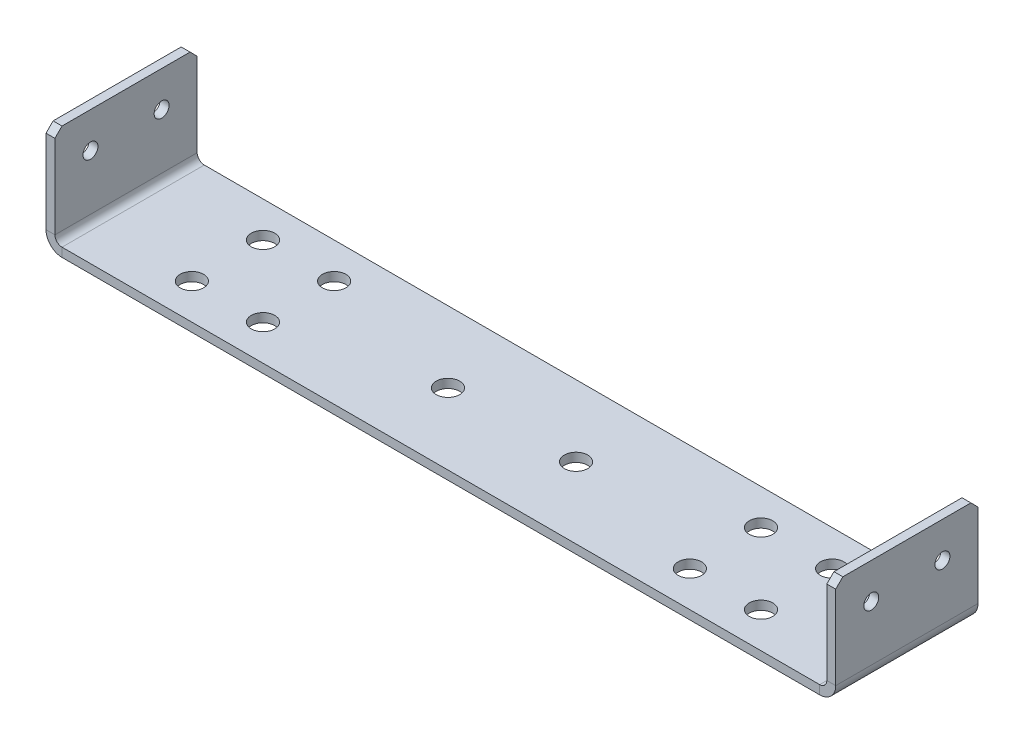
ISO-10303-21;
HEADER;
FILE_DESCRIPTION(('STEP AP214'),'2;1');
FILE_NAME('part.step','',(''),(''),'','','');
FILE_SCHEMA(('AUTOMOTIVE_DESIGN { 1 0 10303 214 1 1 1 1 }'));
ENDSEC;
DATA;
#1=APPLICATION_CONTEXT('core data for automotive mechanical design processes');
#2=APPLICATION_PROTOCOL_DEFINITION('international standard','automotive_design',2000,#1);
#3=PRODUCT_CONTEXT('',#1,'mechanical');
#4=PRODUCT('Part','Part','',(#3));
#5=PRODUCT_RELATED_PRODUCT_CATEGORY('part','',(#4));
#6=PRODUCT_DEFINITION_FORMATION('','',#4);
#7=PRODUCT_DEFINITION_CONTEXT('part definition',#1,'design');
#8=PRODUCT_DEFINITION('design','',#6,#7);
#9=PRODUCT_DEFINITION_SHAPE('','',#8);
#10=(LENGTH_UNIT() NAMED_UNIT(*) SI_UNIT(.MILLI.,.METRE.));
#11=(NAMED_UNIT(*) PLANE_ANGLE_UNIT() SI_UNIT($,.RADIAN.));
#12=(NAMED_UNIT(*) SI_UNIT($,.STERADIAN.) SOLID_ANGLE_UNIT());
#13=UNCERTAINTY_MEASURE_WITH_UNIT(LENGTH_MEASURE(1.E-05),#10,'distance_accuracy_value','');
#14=(GEOMETRIC_REPRESENTATION_CONTEXT(3) GLOBAL_UNCERTAINTY_ASSIGNED_CONTEXT((#13)) GLOBAL_UNIT_ASSIGNED_CONTEXT((#10,
#11,#12)) REPRESENTATION_CONTEXT('',''));
#15=CARTESIAN_POINT('',(0.,0.,0.));
#16=DIRECTION('',(0.,0.,1.));
#17=DIRECTION('',(1.,0.,0.));
#18=AXIS2_PLACEMENT_3D('',#15,#16,#17);
#19=CARTESIAN_POINT('',(-111.,4.5,20.));
#20=DIRECTION('',(0.,0.,1.));
#21=DIRECTION('',(1.,0.,0.));
#22=AXIS2_PLACEMENT_3D('',#19,#20,#21);
#23=PLANE('',#22);
#24=DIRECTION('',(1.,0.,0.));
#25=VECTOR('',#24,1.);
#26=CARTESIAN_POINT('',(-111.,4.5,20.));
#27=LINE('',#26,#25);
#28=CARTESIAN_POINT('',(-111.,4.5,20.));
#29=VERTEX_POINT('',#28);
#30=CARTESIAN_POINT('',(-108.5,4.5,20.));
#31=VERTEX_POINT('',#30);
#32=EDGE_CURVE('E279',#29,#31,#27,.T.);
#33=ORIENTED_EDGE('',*,*,#32,.F.);
#34=CARTESIAN_POINT('',(-106.5,4.5,20.));
#35=DIRECTION('',(0.,0.,-1.));
#36=DIRECTION('',(-1.,0.,0.));
#37=AXIS2_PLACEMENT_3D('',#34,#35,#36);
#38=CIRCLE('',#37,4.5);
#39=CARTESIAN_POINT('',(-106.5,0.,20.));
#40=VERTEX_POINT('',#39);
#41=EDGE_CURVE('E206',#29,#40,#38,.F.);
#42=ORIENTED_EDGE('',*,*,#41,.T.);
#43=DIRECTION('',(0.,-1.,0.));
#44=VECTOR('',#43,1.);
#45=CARTESIAN_POINT('',(-106.5,2.5,20.));
#46=LINE('',#45,#44);
#47=CARTESIAN_POINT('',(-106.5,2.5,20.));
#48=VERTEX_POINT('',#47);
#49=EDGE_CURVE('E277',#48,#40,#46,.T.);
#50=ORIENTED_EDGE('',*,*,#49,.F.);
#51=CARTESIAN_POINT('',(-106.5,4.5,20.));
#52=DIRECTION('',(0.,0.,1.));
#53=DIRECTION('',(1.,0.,0.));
#54=AXIS2_PLACEMENT_3D('',#51,#52,#53);
#55=CIRCLE('',#54,2.);
#56=EDGE_CURVE('E196',#31,#48,#55,.T.);
#57=ORIENTED_EDGE('',*,*,#56,.F.);
#58=EDGE_LOOP('',(#33,#42,#50,#57));
#59=FACE_BOUND('',#58,.T.);
#60=ADVANCED_FACE('F38',(#59),#23,.T.);
#61=CARTESIAN_POINT('',(-106.5,2.5,20.));
#62=DIRECTION('',(0.,0.,1.));
#63=DIRECTION('',(1.,0.,0.));
#64=AXIS2_PLACEMENT_3D('',#61,#62,#63);
#65=PLANE('',#64);
#66=DIRECTION('',(0.,1.,0.));
#67=VECTOR('',#66,1.);
#68=CARTESIAN_POINT('',(-108.5,30.,20.));
#69=LINE('',#68,#67);
#70=CARTESIAN_POINT('',(-108.5,28.,20.));
#71=VERTEX_POINT('',#70);
#72=EDGE_CURVE('E202',#71,#31,#69,.F.);
#73=ORIENTED_EDGE('',*,*,#72,.F.);
#74=DIRECTION('',(-1.,0.,0.));
#75=VECTOR('',#74,1.);
#76=CARTESIAN_POINT('',(-106.5,28.,20.));
#77=LINE('',#76,#75);
#78=CARTESIAN_POINT('',(-111.,28.,20.));
#79=VERTEX_POINT('',#78);
#80=EDGE_CURVE('E63',#71,#79,#77,.T.);
#81=ORIENTED_EDGE('',*,*,#80,.T.);
#82=DIRECTION('',(0.,-1.,0.));
#83=VECTOR('',#82,1.);
#84=CARTESIAN_POINT('',(-111.,30.,20.));
#85=LINE('',#84,#83);
#86=EDGE_CURVE('E204',#79,#29,#85,.T.);
#87=ORIENTED_EDGE('',*,*,#86,.T.);
#88=ORIENTED_EDGE('',*,*,#32,.T.);
#89=EDGE_LOOP('',(#73,#81,#87,#88));
#90=FACE_BOUND('',#89,.T.);
#91=ADVANCED_FACE('F405',(#90),#65,.T.);
#92=CARTESIAN_POINT('',(-106.5,0.,-20.));
#93=DIRECTION('',(0.,0.,-1.));
#94=DIRECTION('',(-1.,0.,0.));
#95=AXIS2_PLACEMENT_3D('',#92,#93,#94);
#96=PLANE('',#95);
#97=DIRECTION('',(0.,1.,0.));
#98=VECTOR('',#97,1.);
#99=CARTESIAN_POINT('',(-106.5,0.,-20.));
#100=LINE('',#99,#98);
#101=CARTESIAN_POINT('',(-106.5,0.,-20.));
#102=VERTEX_POINT('',#101);
#103=CARTESIAN_POINT('',(-106.5,2.5,-20.));
#104=VERTEX_POINT('',#103);
#105=EDGE_CURVE('E275',#102,#104,#100,.T.);
#106=ORIENTED_EDGE('',*,*,#105,.F.);
#107=CARTESIAN_POINT('',(-106.5,4.5,-20.));
#108=DIRECTION('',(0.,0.,-1.));
#109=DIRECTION('',(-1.,0.,0.));
#110=AXIS2_PLACEMENT_3D('',#107,#108,#109);
#111=CIRCLE('',#110,4.5);
#112=CARTESIAN_POINT('',(-111.,4.5,-20.));
#113=VERTEX_POINT('',#112);
#114=EDGE_CURVE('E231',#113,#102,#111,.F.);
#115=ORIENTED_EDGE('',*,*,#114,.F.);
#116=DIRECTION('',(-1.,0.,0.));
#117=VECTOR('',#116,1.);
#118=CARTESIAN_POINT('',(-108.5,4.5,-20.));
#119=LINE('',#118,#117);
#120=CARTESIAN_POINT('',(-108.5,4.5,-20.));
#121=VERTEX_POINT('',#120);
#122=EDGE_CURVE('E272',#121,#113,#119,.T.);
#123=ORIENTED_EDGE('',*,*,#122,.F.);
#124=CARTESIAN_POINT('',(-106.5,4.5,-20.));
#125=DIRECTION('',(0.,0.,1.));
#126=DIRECTION('',(1.,0.,0.));
#127=AXIS2_PLACEMENT_3D('',#124,#125,#126);
#128=CIRCLE('',#127,2.);
#129=EDGE_CURVE('E224',#121,#104,#128,.T.);
#130=ORIENTED_EDGE('',*,*,#129,.T.);
#131=EDGE_LOOP('',(#106,#115,#123,#130));
#132=FACE_BOUND('',#131,.T.);
#133=ADVANCED_FACE('F411',(#132),#96,.T.);
#134=CARTESIAN_POINT('',(-108.5,4.5,-20.));
#135=DIRECTION('',(0.,0.,-1.));
#136=DIRECTION('',(-1.,0.,0.));
#137=AXIS2_PLACEMENT_3D('',#134,#135,#136);
#138=PLANE('',#137);
#139=DIRECTION('',(1.,0.,0.));
#140=VECTOR('',#139,1.);
#141=CARTESIAN_POINT('',(-111.,0.,-20.));
#142=LINE('',#141,#140);
#143=CARTESIAN_POINT('',(106.5,0.,-20.));
#144=VERTEX_POINT('',#143);
#145=EDGE_CURVE('E234',#102,#144,#142,.T.);
#146=ORIENTED_EDGE('',*,*,#145,.F.);
#147=ORIENTED_EDGE('',*,*,#105,.T.);
#148=DIRECTION('',(1.,0.,0.));
#149=VECTOR('',#148,1.);
#150=CARTESIAN_POINT('',(-111.,2.5,-20.));
#151=LINE('',#150,#149);
#152=CARTESIAN_POINT('',(106.5,2.50000000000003,-20.));
#153=VERTEX_POINT('',#152);
#154=EDGE_CURVE('E221',#104,#153,#151,.T.);
#155=ORIENTED_EDGE('',*,*,#154,.T.);
#156=DIRECTION('',(0.,-1.,0.));
#157=VECTOR('',#156,1.);
#158=CARTESIAN_POINT('',(106.5,2.50000000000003,-20.));
#159=LINE('',#158,#157);
#160=EDGE_CURVE('E268',#153,#144,#159,.T.);
#161=ORIENTED_EDGE('',*,*,#160,.T.);
#162=EDGE_LOOP('',(#146,#147,#155,#161));
#163=FACE_BOUND('',#162,.T.);
#164=ADVANCED_FACE('F466',(#163),#138,.T.);
#165=CARTESIAN_POINT('',(106.5,0.,20.));
#166=DIRECTION('',(0.,0.,1.));
#167=DIRECTION('',(1.,0.,0.));
#168=AXIS2_PLACEMENT_3D('',#165,#166,#167);
#169=PLANE('',#168);
#170=DIRECTION('',(0.,1.,0.));
#171=VECTOR('',#170,1.);
#172=CARTESIAN_POINT('',(106.5,0.,20.));
#173=LINE('',#172,#171);
#174=CARTESIAN_POINT('',(106.5,0.,20.));
#175=VERTEX_POINT('',#174);
#176=CARTESIAN_POINT('',(106.5,2.50000000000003,20.));
#177=VERTEX_POINT('',#176);
#178=EDGE_CURVE('E167',#175,#177,#173,.T.);
#179=ORIENTED_EDGE('',*,*,#178,.F.);
#180=CARTESIAN_POINT('',(106.5,4.50000000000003,20.));
#181=DIRECTION('',(0.,0.,-1.));
#182=DIRECTION('',(-1.,0.,0.));
#183=AXIS2_PLACEMENT_3D('',#180,#181,#182);
#184=CIRCLE('',#183,4.5);
#185=CARTESIAN_POINT('',(111.,4.50000000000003,20.));
#186=VERTEX_POINT('',#185);
#187=EDGE_CURVE('E162',#175,#186,#184,.F.);
#188=ORIENTED_EDGE('',*,*,#187,.T.);
#189=DIRECTION('',(1.,0.,0.));
#190=VECTOR('',#189,1.);
#191=CARTESIAN_POINT('',(108.5,4.50000000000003,20.));
#192=LINE('',#191,#190);
#193=CARTESIAN_POINT('',(108.5,4.50000000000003,20.));
#194=VERTEX_POINT('',#193);
#195=EDGE_CURVE('E155',#194,#186,#192,.T.);
#196=ORIENTED_EDGE('',*,*,#195,.F.);
#197=CARTESIAN_POINT('',(106.5,4.50000000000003,20.));
#198=DIRECTION('',(0.,0.,1.));
#199=DIRECTION('',(1.,0.,0.));
#200=AXIS2_PLACEMENT_3D('',#197,#198,#199);
#201=CIRCLE('',#200,2.);
#202=EDGE_CURVE('E159',#177,#194,#201,.T.);
#203=ORIENTED_EDGE('',*,*,#202,.F.);
#204=EDGE_LOOP('',(#179,#188,#196,#203));
#205=FACE_BOUND('',#204,.T.);
#206=ADVANCED_FACE('F157',(#205),#169,.T.);
#207=CARTESIAN_POINT('',(108.5,4.50000000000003,20.));
#208=DIRECTION('',(0.,0.,1.));
#209=DIRECTION('',(1.,0.,0.));
#210=AXIS2_PLACEMENT_3D('',#207,#208,#209);
#211=PLANE('',#210);
#212=DIRECTION('',(1.,0.,0.));
#213=VECTOR('',#212,1.);
#214=CARTESIAN_POINT('',(-111.,0.,20.));
#215=LINE('',#214,#213);
#216=EDGE_CURVE('E209',#40,#175,#215,.T.);
#217=ORIENTED_EDGE('',*,*,#216,.T.);
#218=ORIENTED_EDGE('',*,*,#178,.T.);
#219=DIRECTION('',(1.,0.,0.));
#220=VECTOR('',#219,1.);
#221=CARTESIAN_POINT('',(-111.,2.5,20.));
#222=LINE('',#221,#220);
#223=EDGE_CURVE('E194',#48,#177,#222,.T.);
#224=ORIENTED_EDGE('',*,*,#223,.F.);
#225=ORIENTED_EDGE('',*,*,#49,.T.);
#226=EDGE_LOOP('',(#217,#218,#224,#225));
#227=FACE_BOUND('',#226,.T.);
#228=ADVANCED_FACE('F461',(#227),#211,.T.);
#229=CARTESIAN_POINT('',(111.,4.50000000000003,-20.));
#230=DIRECTION('',(0.,0.,-1.));
#231=DIRECTION('',(-1.,0.,0.));
#232=AXIS2_PLACEMENT_3D('',#229,#230,#231);
#233=PLANE('',#232);
#234=DIRECTION('',(-1.,0.,0.));
#235=VECTOR('',#234,1.);
#236=CARTESIAN_POINT('',(111.,4.50000000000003,-20.));
#237=LINE('',#236,#235);
#238=CARTESIAN_POINT('',(111.,4.50000000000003,-20.));
#239=VERTEX_POINT('',#238);
#240=CARTESIAN_POINT('',(108.5,4.50000000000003,-20.));
#241=VERTEX_POINT('',#240);
#242=EDGE_CURVE('E168',#239,#241,#237,.T.);
#243=ORIENTED_EDGE('',*,*,#242,.F.);
#244=CARTESIAN_POINT('',(106.5,4.50000000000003,-20.));
#245=DIRECTION('',(0.,0.,-1.));
#246=DIRECTION('',(-1.,0.,0.));
#247=AXIS2_PLACEMENT_3D('',#244,#245,#246);
#248=CIRCLE('',#247,4.5);
#249=EDGE_CURVE('E237',#144,#239,#248,.F.);
#250=ORIENTED_EDGE('',*,*,#249,.F.);
#251=ORIENTED_EDGE('',*,*,#160,.F.);
#252=CARTESIAN_POINT('',(106.5,4.50000000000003,-20.));
#253=DIRECTION('',(0.,0.,1.));
#254=DIRECTION('',(1.,0.,0.));
#255=AXIS2_PLACEMENT_3D('',#252,#253,#254);
#256=CIRCLE('',#255,2.);
#257=EDGE_CURVE('E219',#153,#241,#256,.T.);
#258=ORIENTED_EDGE('',*,*,#257,.T.);
#259=EDGE_LOOP('',(#243,#250,#251,#258));
#260=FACE_BOUND('',#259,.T.);
#261=ADVANCED_FACE('F389',(#260),#233,.T.);
#262=CARTESIAN_POINT('',(106.5,2.50000000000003,-20.));
#263=DIRECTION('',(0.,0.,-1.));
#264=DIRECTION('',(-1.,0.,0.));
#265=AXIS2_PLACEMENT_3D('',#262,#263,#264);
#266=PLANE('',#265);
#267=DIRECTION('',(0.,1.,0.));
#268=VECTOR('',#267,1.);
#269=CARTESIAN_POINT('',(108.5,0.,-20.));
#270=LINE('',#269,#268);
#271=CARTESIAN_POINT('',(108.5,28.,-20.));
#272=VERTEX_POINT('',#271);
#273=EDGE_CURVE('E179',#241,#272,#270,.T.);
#274=ORIENTED_EDGE('',*,*,#273,.T.);
#275=DIRECTION('',(1.,0.,0.));
#276=VECTOR('',#275,1.);
#277=CARTESIAN_POINT('',(106.5,28.,-20.));
#278=LINE('',#277,#276);
#279=CARTESIAN_POINT('',(111.,28.,-20.));
#280=VERTEX_POINT('',#279);
#281=EDGE_CURVE('E296',#272,#280,#278,.T.);
#282=ORIENTED_EDGE('',*,*,#281,.T.);
#283=DIRECTION('',(0.,1.,0.));
#284=VECTOR('',#283,1.);
#285=CARTESIAN_POINT('',(111.,0.,-20.));
#286=LINE('',#285,#284);
#287=EDGE_CURVE('E214',#239,#280,#286,.T.);
#288=ORIENTED_EDGE('',*,*,#287,.F.);
#289=ORIENTED_EDGE('',*,*,#242,.T.);
#290=EDGE_LOOP('',(#274,#282,#288,#289));
#291=FACE_BOUND('',#290,.T.);
#292=ADVANCED_FACE('F385',(#291),#266,.T.);
#293=CARTESIAN_POINT('',(111.,0.,20.));
#294=DIRECTION('',(-1.,0.,0.));
#295=DIRECTION('',(0.,-1.,0.));
#296=AXIS2_PLACEMENT_3D('',#293,#294,#295);
#297=PLANE('',#296);
#298=CARTESIAN_POINT('',(111.,20.,-10.));
#299=DIRECTION('',(-1.,0.,0.));
#300=DIRECTION('',(0.,-1.,0.));
#301=AXIS2_PLACEMENT_3D('',#298,#299,#300);
#302=CIRCLE('',#301,2.1);
#303=CARTESIAN_POINT('',(111.,17.9,-10.));
#304=VERTEX_POINT('',#303);
#305=EDGE_CURVE('E363',#304,#304,#302,.T.);
#306=ORIENTED_EDGE('',*,*,#305,.T.);
#307=EDGE_LOOP('',(#306));
#308=FACE_BOUND('',#307,.T.);
#309=CARTESIAN_POINT('',(111.,20.,10.));
#310=DIRECTION('',(-1.,0.,0.));
#311=DIRECTION('',(0.,-1.,0.));
#312=AXIS2_PLACEMENT_3D('',#309,#310,#311);
#313=CIRCLE('',#312,2.1);
#314=CARTESIAN_POINT('',(111.,17.9,10.));
#315=VERTEX_POINT('',#314);
#316=EDGE_CURVE('E217',#315,#315,#313,.T.);
#317=ORIENTED_EDGE('',*,*,#316,.T.);
#318=EDGE_LOOP('',(#317));
#319=FACE_BOUND('',#318,.T.);
#320=DIRECTION('',(0.,0.,-1.));
#321=VECTOR('',#320,1.);
#322=CARTESIAN_POINT('',(111.,30.,20.));
#323=LINE('',#322,#321);
#324=CARTESIAN_POINT('',(111.,30.,18.));
#325=VERTEX_POINT('',#324);
#326=CARTESIAN_POINT('',(111.,30.,-18.));
#327=VERTEX_POINT('',#326);
#328=EDGE_CURVE('E265',#325,#327,#323,.T.);
#329=ORIENTED_EDGE('',*,*,#328,.F.);
#330=DIRECTION('',(0.,0.707106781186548,-0.707106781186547));
#331=VECTOR('',#330,1.);
#332=CARTESIAN_POINT('',(111.,30.,18.));
#333=LINE('',#332,#331);
#334=CARTESIAN_POINT('',(111.,28.,20.));
#335=VERTEX_POINT('',#334);
#336=EDGE_CURVE('E289',#325,#335,#333,.F.);
#337=ORIENTED_EDGE('',*,*,#336,.T.);
#338=DIRECTION('',(0.,1.,0.));
#339=VECTOR('',#338,1.);
#340=CARTESIAN_POINT('',(111.,0.,20.));
#341=LINE('',#340,#339);
#342=EDGE_CURVE('E189',#186,#335,#341,.T.);
#343=ORIENTED_EDGE('',*,*,#342,.F.);
#344=DIRECTION('',(0.,0.,-1.));
#345=VECTOR('',#344,1.);
#346=CARTESIAN_POINT('',(111.,4.50000000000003,20.));
#347=LINE('',#346,#345);
#348=EDGE_CURVE('E213',#186,#239,#347,.T.);
#349=ORIENTED_EDGE('',*,*,#348,.T.);
#350=ORIENTED_EDGE('',*,*,#287,.T.);
#351=DIRECTION('',(0.,-0.707106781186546,-0.707106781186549));
#352=VECTOR('',#351,1.);
#353=CARTESIAN_POINT('',(111.,28.,-20.));
#354=LINE('',#353,#352);
#355=EDGE_CURVE('E287',#280,#327,#354,.F.);
#356=ORIENTED_EDGE('',*,*,#355,.T.);
#357=EDGE_LOOP('',(#329,#337,#343,#349,#350,#356));
#358=FACE_BOUND('',#357,.T.);
#359=ADVANCED_FACE('F393',(#308,#319,#358),#297,.F.);
#360=CARTESIAN_POINT('',(108.5,30.,20.));
#361=DIRECTION('',(0.,1.,0.));
#362=DIRECTION('',(-1.,0.,0.));
#363=AXIS2_PLACEMENT_3D('',#360,#361,#362);
#364=PLANE('',#363);
#365=DIRECTION('',(0.,0.,-1.));
#366=VECTOR('',#365,1.);
#367=CARTESIAN_POINT('',(108.5,30.,20.));
#368=LINE('',#367,#366);
#369=CARTESIAN_POINT('',(108.5,30.,18.));
#370=VERTEX_POINT('',#369);
#371=CARTESIAN_POINT('',(108.5,30.,-18.));
#372=VERTEX_POINT('',#371);
#373=EDGE_CURVE('E183',#370,#372,#368,.T.);
#374=ORIENTED_EDGE('',*,*,#373,.F.);
#375=DIRECTION('',(1.,0.,0.));
#376=VECTOR('',#375,1.);
#377=CARTESIAN_POINT('',(108.5,30.,18.));
#378=LINE('',#377,#376);
#379=EDGE_CURVE('E284',#370,#325,#378,.T.);
#380=ORIENTED_EDGE('',*,*,#379,.T.);
#381=ORIENTED_EDGE('',*,*,#328,.T.);
#382=DIRECTION('',(-1.,0.,0.));
#383=VECTOR('',#382,1.);
#384=CARTESIAN_POINT('',(108.5,30.,-18.));
#385=LINE('',#384,#383);
#386=EDGE_CURVE('E282',#327,#372,#385,.T.);
#387=ORIENTED_EDGE('',*,*,#386,.T.);
#388=EDGE_LOOP('',(#374,#380,#381,#387));
#389=FACE_BOUND('',#388,.T.);
#390=ADVANCED_FACE('F378',(#389),#364,.T.);
#391=CARTESIAN_POINT('',(108.5,0.,20.));
#392=DIRECTION('',(-1.,0.,0.));
#393=DIRECTION('',(0.,-1.,0.));
#394=AXIS2_PLACEMENT_3D('',#391,#392,#393);
#395=PLANE('',#394);
#396=CARTESIAN_POINT('',(108.5,20.,-10.));
#397=DIRECTION('',(-1.,0.,0.));
#398=DIRECTION('',(0.,0.,1.));
#399=AXIS2_PLACEMENT_3D('',#396,#397,#398);
#400=CIRCLE('',#399,2.1);
#401=CARTESIAN_POINT('',(108.5,20.,-7.9));
#402=VERTEX_POINT('',#401);
#403=EDGE_CURVE('E314',#402,#402,#400,.T.);
#404=ORIENTED_EDGE('',*,*,#403,.F.);
#405=EDGE_LOOP('',(#404));
#406=FACE_BOUND('',#405,.T.);
#407=CARTESIAN_POINT('',(108.5,20.,10.));
#408=DIRECTION('',(-1.,0.,0.));
#409=DIRECTION('',(0.,0.,1.));
#410=AXIS2_PLACEMENT_3D('',#407,#408,#409);
#411=CIRCLE('',#410,2.1);
#412=CARTESIAN_POINT('',(108.5,20.,12.1));
#413=VERTEX_POINT('',#412);
#414=EDGE_CURVE('E366',#413,#413,#411,.T.);
#415=ORIENTED_EDGE('',*,*,#414,.F.);
#416=EDGE_LOOP('',(#415));
#417=FACE_BOUND('',#416,.T.);
#418=DIRECTION('',(0.,1.,0.));
#419=VECTOR('',#418,1.);
#420=CARTESIAN_POINT('',(108.5,0.,20.));
#421=LINE('',#420,#419);
#422=CARTESIAN_POINT('',(108.5,28.,20.));
#423=VERTEX_POINT('',#422);
#424=EDGE_CURVE('E176',#194,#423,#421,.T.);
#425=ORIENTED_EDGE('',*,*,#424,.T.);
#426=DIRECTION('',(0.,-0.707106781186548,0.707106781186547));
#427=VECTOR('',#426,1.);
#428=CARTESIAN_POINT('',(108.5,14.,34.));
#429=LINE('',#428,#427);
#430=EDGE_CURVE('E294',#423,#370,#429,.F.);
#431=ORIENTED_EDGE('',*,*,#430,.T.);
#432=ORIENTED_EDGE('',*,*,#373,.T.);
#433=DIRECTION('',(0.,0.707106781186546,0.707106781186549));
#434=VECTOR('',#433,1.);
#435=CARTESIAN_POINT('',(108.5,34.0000000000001,-13.9999999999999));
#436=LINE('',#435,#434);
#437=EDGE_CURVE('E292',#372,#272,#436,.F.);
#438=ORIENTED_EDGE('',*,*,#437,.T.);
#439=ORIENTED_EDGE('',*,*,#273,.F.);
#440=DIRECTION('',(0.,0.,-1.));
#441=VECTOR('',#440,1.);
#442=CARTESIAN_POINT('',(108.5,4.50000000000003,20.));
#443=LINE('',#442,#441);
#444=EDGE_CURVE('E174',#194,#241,#443,.T.);
#445=ORIENTED_EDGE('',*,*,#444,.F.);
#446=EDGE_LOOP('',(#425,#431,#432,#438,#439,#445));
#447=FACE_BOUND('',#446,.T.);
#448=ADVANCED_FACE('F175',(#406,#417,#447),#395,.T.);
#449=CARTESIAN_POINT('',(106.5,4.50000000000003,20.));
#450=DIRECTION('',(0.,0.,-1.));
#451=DIRECTION('',(-1.,0.,0.));
#452=AXIS2_PLACEMENT_3D('',#449,#450,#451);
#453=CYLINDRICAL_SURFACE('',#452,2.);
#454=ORIENTED_EDGE('',*,*,#257,.F.);
#455=DIRECTION('',(0.,0.,-1.));
#456=VECTOR('',#455,1.);
#457=CARTESIAN_POINT('',(106.5,2.50000000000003,20.));
#458=LINE('',#457,#456);
#459=EDGE_CURVE('E184',#177,#153,#458,.T.);
#460=ORIENTED_EDGE('',*,*,#459,.F.);
#461=ORIENTED_EDGE('',*,*,#202,.T.);
#462=ORIENTED_EDGE('',*,*,#444,.T.);
#463=EDGE_LOOP('',(#454,#460,#461,#462));
#464=FACE_BOUND('',#463,.T.);
#465=ADVANCED_FACE('F192',(#464),#453,.F.);
#466=CARTESIAN_POINT('',(-111.,2.5,20.));
#467=DIRECTION('',(0.,1.,0.));
#468=DIRECTION('',(-1.,0.,0.));
#469=AXIS2_PLACEMENT_3D('',#466,#467,#468);
#470=PLANE('',#469);
#471=CARTESIAN_POINT('',(80.,2.50000000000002,10.));
#472=DIRECTION('',(0.,1.,0.));
#473=DIRECTION('',(0.,0.,1.));
#474=AXIS2_PLACEMENT_3D('',#471,#472,#473);
#475=CIRCLE('',#474,3.29999999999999);
#476=CARTESIAN_POINT('',(80.,2.50000000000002,13.3));
#477=VERTEX_POINT('',#476);
#478=EDGE_CURVE('E846',#477,#477,#475,.T.);
#479=ORIENTED_EDGE('',*,*,#478,.F.);
#480=EDGE_LOOP('',(#479));
#481=FACE_BOUND('',#480,.T.);
#482=CARTESIAN_POINT('',(60.,2.50000000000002,-10.));
#483=DIRECTION('',(0.,1.,0.));
#484=DIRECTION('',(0.,0.,1.));
#485=AXIS2_PLACEMENT_3D('',#482,#483,#484);
#486=CIRCLE('',#485,3.29999999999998);
#487=CARTESIAN_POINT('',(60.,2.50000000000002,-6.70000000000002));
#488=VERTEX_POINT('',#487);
#489=EDGE_CURVE('E850',#488,#488,#486,.T.);
#490=ORIENTED_EDGE('',*,*,#489,.F.);
#491=EDGE_LOOP('',(#490));
#492=FACE_BOUND('',#491,.T.);
#493=CARTESIAN_POINT('',(80.,2.50000000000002,-10.));
#494=DIRECTION('',(0.,1.,0.));
#495=DIRECTION('',(0.,0.,1.));
#496=AXIS2_PLACEMENT_3D('',#493,#494,#495);
#497=CIRCLE('',#496,3.29999999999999);
#498=CARTESIAN_POINT('',(80.,2.50000000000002,-6.70000000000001));
#499=VERTEX_POINT('',#498);
#500=EDGE_CURVE('E859',#499,#499,#497,.T.);
#501=ORIENTED_EDGE('',*,*,#500,.F.);
#502=EDGE_LOOP('',(#501));
#503=FACE_BOUND('',#502,.T.);
#504=CARTESIAN_POINT('',(60.,2.50000000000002,10.));
#505=DIRECTION('',(0.,1.,0.));
#506=DIRECTION('',(0.,0.,1.));
#507=AXIS2_PLACEMENT_3D('',#504,#505,#506);
#508=CIRCLE('',#507,3.29999999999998);
#509=CARTESIAN_POINT('',(60.,2.50000000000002,13.3));
#510=VERTEX_POINT('',#509);
#511=EDGE_CURVE('E865',#510,#510,#508,.T.);
#512=ORIENTED_EDGE('',*,*,#511,.F.);
#513=EDGE_LOOP('',(#512));
#514=FACE_BOUND('',#513,.T.);
#515=CARTESIAN_POINT('',(-80.,2.5,10.));
#516=DIRECTION('',(0.,1.,0.));
#517=DIRECTION('',(0.,0.,1.));
#518=AXIS2_PLACEMENT_3D('',#515,#516,#517);
#519=CIRCLE('',#518,3.29999999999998);
#520=CARTESIAN_POINT('',(-80.,2.5,13.3));
#521=VERTEX_POINT('',#520);
#522=EDGE_CURVE('E340',#521,#521,#519,.T.);
#523=ORIENTED_EDGE('',*,*,#522,.F.);
#524=EDGE_LOOP('',(#523));
#525=FACE_BOUND('',#524,.T.);
#526=CARTESIAN_POINT('',(-60.,2.50000000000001,10.));
#527=DIRECTION('',(0.,1.,0.));
#528=DIRECTION('',(0.,0.,1.));
#529=AXIS2_PLACEMENT_3D('',#526,#527,#528);
#530=CIRCLE('',#529,3.29999999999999);
#531=CARTESIAN_POINT('',(-60.,2.50000000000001,13.3));
#532=VERTEX_POINT('',#531);
#533=EDGE_CURVE('E330',#532,#532,#530,.T.);
#534=ORIENTED_EDGE('',*,*,#533,.F.);
#535=EDGE_LOOP('',(#534));
#536=FACE_BOUND('',#535,.T.);
#537=CARTESIAN_POINT('',(-80.,2.5,-10.));
#538=DIRECTION('',(0.,1.,0.));
#539=DIRECTION('',(0.,0.,1.));
#540=AXIS2_PLACEMENT_3D('',#537,#538,#539);
#541=CIRCLE('',#540,3.29999999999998);
#542=CARTESIAN_POINT('',(-80.,2.5,-6.70000000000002));
#543=VERTEX_POINT('',#542);
#544=EDGE_CURVE('E327',#543,#543,#541,.T.);
#545=ORIENTED_EDGE('',*,*,#544,.F.);
#546=EDGE_LOOP('',(#545));
#547=FACE_BOUND('',#546,.T.);
#548=CARTESIAN_POINT('',(-60.,2.50000000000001,-10.));
#549=DIRECTION('',(0.,1.,0.));
#550=DIRECTION('',(0.,0.,1.));
#551=AXIS2_PLACEMENT_3D('',#548,#549,#550);
#552=CIRCLE('',#551,3.29999999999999);
#553=CARTESIAN_POINT('',(-60.,2.50000000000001,-6.70000000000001));
#554=VERTEX_POINT('',#553);
#555=EDGE_CURVE('E324',#554,#554,#552,.T.);
#556=ORIENTED_EDGE('',*,*,#555,.F.);
#557=EDGE_LOOP('',(#556));
#558=FACE_BOUND('',#557,.T.);
#559=CARTESIAN_POINT('',(18.,2.50000000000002,0.));
#560=DIRECTION('',(0.,1.,0.));
#561=DIRECTION('',(-1.,0.,0.));
#562=AXIS2_PLACEMENT_3D('',#559,#560,#561);
#563=CIRCLE('',#562,3.29999999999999);
#564=CARTESIAN_POINT('',(14.7,2.50000000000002,0.));
#565=VERTEX_POINT('',#564);
#566=EDGE_CURVE('E348',#565,#565,#563,.T.);
#567=ORIENTED_EDGE('',*,*,#566,.F.);
#568=EDGE_LOOP('',(#567));
#569=FACE_BOUND('',#568,.T.);
#570=CARTESIAN_POINT('',(-18.,2.50000000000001,0.));
#571=DIRECTION('',(0.,1.,0.));
#572=DIRECTION('',(-1.,0.,0.));
#573=AXIS2_PLACEMENT_3D('',#570,#571,#572);
#574=CIRCLE('',#573,3.29999999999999);
#575=CARTESIAN_POINT('',(-21.3,2.50000000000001,0.));
#576=VERTEX_POINT('',#575);
#577=EDGE_CURVE('E354',#576,#576,#574,.T.);
#578=ORIENTED_EDGE('',*,*,#577,.F.);
#579=EDGE_LOOP('',(#578));
#580=FACE_BOUND('',#579,.T.);
#581=ORIENTED_EDGE('',*,*,#154,.F.);
#582=DIRECTION('',(0.,0.,-1.));
#583=VECTOR('',#582,1.);
#584=CARTESIAN_POINT('',(-106.5,2.5,20.));
#585=LINE('',#584,#583);
#586=EDGE_CURVE('E259',#48,#104,#585,.T.);
#587=ORIENTED_EDGE('',*,*,#586,.F.);
#588=ORIENTED_EDGE('',*,*,#223,.T.);
#589=ORIENTED_EDGE('',*,*,#459,.T.);
#590=EDGE_LOOP('',(#581,#587,#588,#589));
#591=FACE_BOUND('',#590,.T.);
#592=ADVANCED_FACE('F460',(#481,#492,#503,#514,#525,#536,#547,#558,#569,#580,#591),#470,.T.);
#593=CARTESIAN_POINT('',(-106.5,4.5,20.));
#594=DIRECTION('',(0.,0.,-1.));
#595=DIRECTION('',(-1.,0.,0.));
#596=AXIS2_PLACEMENT_3D('',#593,#594,#595);
#597=CYLINDRICAL_SURFACE('',#596,2.);
#598=ORIENTED_EDGE('',*,*,#129,.F.);
#599=DIRECTION('',(0.,0.,-1.));
#600=VECTOR('',#599,1.);
#601=CARTESIAN_POINT('',(-108.5,4.5,20.));
#602=LINE('',#601,#600);
#603=EDGE_CURVE('E256',#31,#121,#602,.T.);
#604=ORIENTED_EDGE('',*,*,#603,.F.);
#605=ORIENTED_EDGE('',*,*,#56,.T.);
#606=ORIENTED_EDGE('',*,*,#586,.T.);
#607=EDGE_LOOP('',(#598,#604,#605,#606));
#608=FACE_BOUND('',#607,.T.);
#609=ADVANCED_FACE('F447',(#608),#597,.F.);
#610=CARTESIAN_POINT('',(-108.5,30.,20.));
#611=DIRECTION('',(1.,0.,0.));
#612=DIRECTION('',(0.,0.,-1.));
#613=AXIS2_PLACEMENT_3D('',#610,#611,#612);
#614=PLANE('',#613);
#615=CARTESIAN_POINT('',(-108.5,20.,10.));
#616=DIRECTION('',(1.,0.,0.));
#617=DIRECTION('',(0.,0.,-1.));
#618=AXIS2_PLACEMENT_3D('',#615,#616,#617);
#619=CIRCLE('',#618,2.1);
#620=CARTESIAN_POINT('',(-108.5,20.,7.9));
#621=VERTEX_POINT('',#620);
#622=EDGE_CURVE('E319',#621,#621,#619,.T.);
#623=ORIENTED_EDGE('',*,*,#622,.F.);
#624=EDGE_LOOP('',(#623));
#625=FACE_BOUND('',#624,.T.);
#626=CARTESIAN_POINT('',(-108.5,20.,-10.));
#627=DIRECTION('',(1.,0.,0.));
#628=DIRECTION('',(0.,0.,-1.));
#629=AXIS2_PLACEMENT_3D('',#626,#627,#628);
#630=CIRCLE('',#629,2.1);
#631=CARTESIAN_POINT('',(-108.5,20.,-12.1));
#632=VERTEX_POINT('',#631);
#633=EDGE_CURVE('E315',#632,#632,#630,.T.);
#634=ORIENTED_EDGE('',*,*,#633,.F.);
#635=EDGE_LOOP('',(#634));
#636=FACE_BOUND('',#635,.T.);
#637=DIRECTION('',(0.,0.,-1.));
#638=VECTOR('',#637,1.);
#639=CARTESIAN_POINT('',(-108.5,30.,20.));
#640=LINE('',#639,#638);
#641=CARTESIAN_POINT('',(-108.5,30.,18.));
#642=VERTEX_POINT('',#641);
#643=CARTESIAN_POINT('',(-108.5,30.,-18.));
#644=VERTEX_POINT('',#643);
#645=EDGE_CURVE('E253',#642,#644,#640,.T.);
#646=ORIENTED_EDGE('',*,*,#645,.F.);
#647=DIRECTION('',(0.,0.707106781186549,-0.707106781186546));
#648=VECTOR('',#647,1.);
#649=CARTESIAN_POINT('',(-108.5,29.,19.));
#650=LINE('',#649,#648);
#651=EDGE_CURVE('E306',#642,#71,#650,.F.);
#652=ORIENTED_EDGE('',*,*,#651,.T.);
#653=ORIENTED_EDGE('',*,*,#72,.T.);
#654=ORIENTED_EDGE('',*,*,#603,.T.);
#655=DIRECTION('',(0.,1.,0.));
#656=VECTOR('',#655,1.);
#657=CARTESIAN_POINT('',(-108.5,30.,-20.));
#658=LINE('',#657,#656);
#659=CARTESIAN_POINT('',(-108.5,28.,-20.));
#660=VERTEX_POINT('',#659);
#661=EDGE_CURVE('E227',#660,#121,#658,.F.);
#662=ORIENTED_EDGE('',*,*,#661,.F.);
#663=DIRECTION('',(0.,0.707106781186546,0.707106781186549));
#664=VECTOR('',#663,1.);
#665=CARTESIAN_POINT('',(-108.5,49.,1.0000000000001));
#666=LINE('',#665,#664);
#667=EDGE_CURVE('E304',#660,#644,#666,.T.);
#668=ORIENTED_EDGE('',*,*,#667,.T.);
#669=EDGE_LOOP('',(#646,#652,#653,#654,#662,#668));
#670=FACE_BOUND('',#669,.T.);
#671=ADVANCED_FACE('F442',(#625,#636,#670),#614,.T.);
#672=CARTESIAN_POINT('',(-111.,30.,20.));
#673=DIRECTION('',(0.,1.,0.));
#674=DIRECTION('',(0.,0.,1.));
#675=AXIS2_PLACEMENT_3D('',#672,#673,#674);
#676=PLANE('',#675);
#677=DIRECTION('',(0.,0.,-1.));
#678=VECTOR('',#677,1.);
#679=CARTESIAN_POINT('',(-111.,30.,20.));
#680=LINE('',#679,#678);
#681=CARTESIAN_POINT('',(-111.,30.,18.));
#682=VERTEX_POINT('',#681);
#683=CARTESIAN_POINT('',(-111.,30.,-18.));
#684=VERTEX_POINT('',#683);
#685=EDGE_CURVE('E251',#682,#684,#680,.T.);
#686=ORIENTED_EDGE('',*,*,#685,.F.);
#687=DIRECTION('',(1.,0.,0.));
#688=VECTOR('',#687,1.);
#689=CARTESIAN_POINT('',(-111.,30.,18.));
#690=LINE('',#689,#688);
#691=EDGE_CURVE('E301',#682,#642,#690,.T.);
#692=ORIENTED_EDGE('',*,*,#691,.T.);
#693=ORIENTED_EDGE('',*,*,#645,.T.);
#694=DIRECTION('',(-1.,0.,0.));
#695=VECTOR('',#694,1.);
#696=CARTESIAN_POINT('',(-111.,30.,-18.));
#697=LINE('',#696,#695);
#698=EDGE_CURVE('E299',#644,#684,#697,.T.);
#699=ORIENTED_EDGE('',*,*,#698,.T.);
#700=EDGE_LOOP('',(#686,#692,#693,#699));
#701=FACE_BOUND('',#700,.T.);
#702=ADVANCED_FACE('F434',(#701),#676,.T.);
#703=CARTESIAN_POINT('',(-111.,30.,20.));
#704=DIRECTION('',(1.,0.,0.));
#705=DIRECTION('',(0.,0.,-1.));
#706=AXIS2_PLACEMENT_3D('',#703,#704,#705);
#707=PLANE('',#706);
#708=CARTESIAN_POINT('',(-111.,20.,10.));
#709=DIRECTION('',(1.,0.,0.));
#710=DIRECTION('',(0.,0.,-1.));
#711=AXIS2_PLACEMENT_3D('',#708,#709,#710);
#712=CIRCLE('',#711,2.1);
#713=CARTESIAN_POINT('',(-111.,20.,7.9));
#714=VERTEX_POINT('',#713);
#715=EDGE_CURVE('E316',#714,#714,#712,.T.);
#716=ORIENTED_EDGE('',*,*,#715,.T.);
#717=EDGE_LOOP('',(#716));
#718=FACE_BOUND('',#717,.T.);
#719=CARTESIAN_POINT('',(-111.,20.,-10.));
#720=DIRECTION('',(1.,0.,0.));
#721=DIRECTION('',(0.,0.,-1.));
#722=AXIS2_PLACEMENT_3D('',#719,#720,#721);
#723=CIRCLE('',#722,2.1);
#724=CARTESIAN_POINT('',(-111.,20.,-12.1));
#725=VERTEX_POINT('',#724);
#726=EDGE_CURVE('E311',#725,#725,#723,.T.);
#727=ORIENTED_EDGE('',*,*,#726,.T.);
#728=EDGE_LOOP('',(#727));
#729=FACE_BOUND('',#728,.T.);
#730=ORIENTED_EDGE('',*,*,#86,.F.);
#731=DIRECTION('',(0.,-0.707106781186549,0.707106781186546));
#732=VECTOR('',#731,1.);
#733=CARTESIAN_POINT('',(-111.,30.,18.));
#734=LINE('',#733,#732);
#735=EDGE_CURVE('E47',#79,#682,#734,.F.);
#736=ORIENTED_EDGE('',*,*,#735,.T.);
#737=ORIENTED_EDGE('',*,*,#685,.T.);
#738=DIRECTION('',(0.,-0.707106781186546,-0.707106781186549));
#739=VECTOR('',#738,1.);
#740=CARTESIAN_POINT('',(-111.,28.,-20.));
#741=LINE('',#740,#739);
#742=CARTESIAN_POINT('',(-111.,28.,-20.));
#743=VERTEX_POINT('',#742);
#744=EDGE_CURVE('E55',#684,#743,#741,.T.);
#745=ORIENTED_EDGE('',*,*,#744,.T.);
#746=DIRECTION('',(0.,-1.,0.));
#747=VECTOR('',#746,1.);
#748=CARTESIAN_POINT('',(-111.,30.,-20.));
#749=LINE('',#748,#747);
#750=EDGE_CURVE('E229',#743,#113,#749,.T.);
#751=ORIENTED_EDGE('',*,*,#750,.T.);
#752=DIRECTION('',(0.,0.,-1.));
#753=VECTOR('',#752,1.);
#754=CARTESIAN_POINT('',(-111.,4.5,20.));
#755=LINE('',#754,#753);
#756=EDGE_CURVE('E248',#29,#113,#755,.T.);
#757=ORIENTED_EDGE('',*,*,#756,.F.);
#758=EDGE_LOOP('',(#730,#736,#737,#745,#751,#757));
#759=FACE_BOUND('',#758,.T.);
#760=ADVANCED_FACE('F431',(#718,#729,#759),#707,.F.);
#761=CARTESIAN_POINT('',(-106.5,4.5,20.));
#762=DIRECTION('',(0.,0.,-1.));
#763=DIRECTION('',(-1.,0.,0.));
#764=AXIS2_PLACEMENT_3D('',#761,#762,#763);
#765=CYLINDRICAL_SURFACE('',#764,4.5);
#766=ORIENTED_EDGE('',*,*,#114,.T.);
#767=DIRECTION('',(0.,0.,-1.));
#768=VECTOR('',#767,1.);
#769=CARTESIAN_POINT('',(-106.5,0.,20.));
#770=LINE('',#769,#768);
#771=EDGE_CURVE('E245',#40,#102,#770,.T.);
#772=ORIENTED_EDGE('',*,*,#771,.F.);
#773=ORIENTED_EDGE('',*,*,#41,.F.);
#774=ORIENTED_EDGE('',*,*,#756,.T.);
#775=EDGE_LOOP('',(#766,#772,#773,#774));
#776=FACE_BOUND('',#775,.T.);
#777=ADVANCED_FACE('F454',(#776),#765,.T.);
#778=CARTESIAN_POINT('',(-111.,0.,20.));
#779=DIRECTION('',(0.,1.,0.));
#780=DIRECTION('',(-1.,0.,0.));
#781=AXIS2_PLACEMENT_3D('',#778,#779,#780);
#782=PLANE('',#781);
#783=CARTESIAN_POINT('',(80.,0.,10.));
#784=DIRECTION('',(0.,1.,0.));
#785=DIRECTION('',(-1.,0.,0.));
#786=AXIS2_PLACEMENT_3D('',#783,#784,#785);
#787=CIRCLE('',#786,3.29999999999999);
#788=CARTESIAN_POINT('',(76.7,0.,10.));
#789=VERTEX_POINT('',#788);
#790=EDGE_CURVE('E849',#789,#789,#787,.T.);
#791=ORIENTED_EDGE('',*,*,#790,.T.);
#792=EDGE_LOOP('',(#791));
#793=FACE_BOUND('',#792,.T.);
#794=CARTESIAN_POINT('',(60.,0.,-10.));
#795=DIRECTION('',(0.,1.,0.));
#796=DIRECTION('',(-1.,0.,0.));
#797=AXIS2_PLACEMENT_3D('',#794,#795,#796);
#798=CIRCLE('',#797,3.29999999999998);
#799=CARTESIAN_POINT('',(56.7,0.,-10.));
#800=VERTEX_POINT('',#799);
#801=EDGE_CURVE('E853',#800,#800,#798,.T.);
#802=ORIENTED_EDGE('',*,*,#801,.T.);
#803=EDGE_LOOP('',(#802));
#804=FACE_BOUND('',#803,.T.);
#805=CARTESIAN_POINT('',(80.,0.,-10.));
#806=DIRECTION('',(0.,1.,0.));
#807=DIRECTION('',(-1.,0.,0.));
#808=AXIS2_PLACEMENT_3D('',#805,#806,#807);
#809=CIRCLE('',#808,3.29999999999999);
#810=CARTESIAN_POINT('',(76.7,0.,-10.));
#811=VERTEX_POINT('',#810);
#812=EDGE_CURVE('E862',#811,#811,#809,.T.);
#813=ORIENTED_EDGE('',*,*,#812,.T.);
#814=EDGE_LOOP('',(#813));
#815=FACE_BOUND('',#814,.T.);
#816=CARTESIAN_POINT('',(60.,0.,10.));
#817=DIRECTION('',(0.,1.,0.));
#818=DIRECTION('',(-1.,0.,0.));
#819=AXIS2_PLACEMENT_3D('',#816,#817,#818);
#820=CIRCLE('',#819,3.29999999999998);
#821=CARTESIAN_POINT('',(56.7,0.,10.));
#822=VERTEX_POINT('',#821);
#823=EDGE_CURVE('E867',#822,#822,#820,.T.);
#824=ORIENTED_EDGE('',*,*,#823,.T.);
#825=EDGE_LOOP('',(#824));
#826=FACE_BOUND('',#825,.T.);
#827=CARTESIAN_POINT('',(-80.,0.,10.));
#828=DIRECTION('',(0.,1.,0.));
#829=DIRECTION('',(-1.,0.,0.));
#830=AXIS2_PLACEMENT_3D('',#827,#828,#829);
#831=CIRCLE('',#830,3.29999999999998);
#832=CARTESIAN_POINT('',(-83.3,0.,10.));
#833=VERTEX_POINT('',#832);
#834=EDGE_CURVE('E42',#833,#833,#831,.T.);
#835=ORIENTED_EDGE('',*,*,#834,.T.);
#836=EDGE_LOOP('',(#835));
#837=FACE_BOUND('',#836,.T.);
#838=CARTESIAN_POINT('',(-60.,0.,10.));
#839=DIRECTION('',(0.,1.,0.));
#840=DIRECTION('',(-1.,0.,0.));
#841=AXIS2_PLACEMENT_3D('',#838,#839,#840);
#842=CIRCLE('',#841,3.29999999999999);
#843=CARTESIAN_POINT('',(-63.3,0.,10.));
#844=VERTEX_POINT('',#843);
#845=EDGE_CURVE('E328',#844,#844,#842,.T.);
#846=ORIENTED_EDGE('',*,*,#845,.T.);
#847=EDGE_LOOP('',(#846));
#848=FACE_BOUND('',#847,.T.);
#849=CARTESIAN_POINT('',(-80.,0.,-10.));
#850=DIRECTION('',(0.,1.,0.));
#851=DIRECTION('',(-1.,0.,0.));
#852=AXIS2_PLACEMENT_3D('',#849,#850,#851);
#853=CIRCLE('',#852,3.29999999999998);
#854=CARTESIAN_POINT('',(-83.3,0.,-10.));
#855=VERTEX_POINT('',#854);
#856=EDGE_CURVE('E325',#855,#855,#853,.T.);
#857=ORIENTED_EDGE('',*,*,#856,.T.);
#858=EDGE_LOOP('',(#857));
#859=FACE_BOUND('',#858,.T.);
#860=CARTESIAN_POINT('',(-60.,0.,-10.));
#861=DIRECTION('',(0.,1.,0.));
#862=DIRECTION('',(-1.,0.,0.));
#863=AXIS2_PLACEMENT_3D('',#860,#861,#862);
#864=CIRCLE('',#863,3.29999999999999);
#865=CARTESIAN_POINT('',(-63.3,0.,-10.));
#866=VERTEX_POINT('',#865);
#867=EDGE_CURVE('E320',#866,#866,#864,.T.);
#868=ORIENTED_EDGE('',*,*,#867,.T.);
#869=EDGE_LOOP('',(#868));
#870=FACE_BOUND('',#869,.T.);
#871=CARTESIAN_POINT('',(18.,0.,0.));
#872=DIRECTION('',(0.,-1.,0.));
#873=DIRECTION('',(0.,0.,-1.));
#874=AXIS2_PLACEMENT_3D('',#871,#872,#873);
#875=CIRCLE('',#874,3.29999999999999);
#876=CARTESIAN_POINT('',(18.,0.,-3.29999999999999));
#877=VERTEX_POINT('',#876);
#878=EDGE_CURVE('E323',#877,#877,#875,.T.);
#879=ORIENTED_EDGE('',*,*,#878,.F.);
#880=EDGE_LOOP('',(#879));
#881=FACE_BOUND('',#880,.T.);
#882=CARTESIAN_POINT('',(-18.,0.,0.));
#883=DIRECTION('',(0.,-1.,0.));
#884=DIRECTION('',(0.,0.,-1.));
#885=AXIS2_PLACEMENT_3D('',#882,#883,#884);
#886=CIRCLE('',#885,3.29999999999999);
#887=CARTESIAN_POINT('',(-18.,0.,-3.29999999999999));
#888=VERTEX_POINT('',#887);
#889=EDGE_CURVE('E351',#888,#888,#886,.T.);
#890=ORIENTED_EDGE('',*,*,#889,.F.);
#891=EDGE_LOOP('',(#890));
#892=FACE_BOUND('',#891,.T.);
#893=ORIENTED_EDGE('',*,*,#145,.T.);
#894=DIRECTION('',(0.,0.,-1.));
#895=VECTOR('',#894,1.);
#896=CARTESIAN_POINT('',(106.5,0.,20.));
#897=LINE('',#896,#895);
#898=EDGE_CURVE('E242',#175,#144,#897,.T.);
#899=ORIENTED_EDGE('',*,*,#898,.F.);
#900=ORIENTED_EDGE('',*,*,#216,.F.);
#901=ORIENTED_EDGE('',*,*,#771,.T.);
#902=EDGE_LOOP('',(#893,#899,#900,#901));
#903=FACE_BOUND('',#902,.T.);
#904=ADVANCED_FACE('F463',(#793,#804,#815,#826,#837,#848,#859,#870,#881,#892,#903),#782,.F.);
#905=CARTESIAN_POINT('',(106.5,4.50000000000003,20.));
#906=DIRECTION('',(0.,0.,-1.));
#907=DIRECTION('',(-1.,0.,0.));
#908=AXIS2_PLACEMENT_3D('',#905,#906,#907);
#909=CYLINDRICAL_SURFACE('',#908,4.5);
#910=ORIENTED_EDGE('',*,*,#249,.T.);
#911=ORIENTED_EDGE('',*,*,#348,.F.);
#912=ORIENTED_EDGE('',*,*,#187,.F.);
#913=ORIENTED_EDGE('',*,*,#898,.T.);
#914=EDGE_LOOP('',(#910,#911,#912,#913));
#915=FACE_BOUND('',#914,.T.);
#916=ADVANCED_FACE('F391',(#915),#909,.T.);
#917=CARTESIAN_POINT('',(106.5,4.50000000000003,20.));
#918=DIRECTION('',(0.,0.,1.));
#919=DIRECTION('',(1.,0.,0.));
#920=AXIS2_PLACEMENT_3D('',#917,#918,#919);
#921=PLANE('',#920);
#922=ORIENTED_EDGE('',*,*,#342,.T.);
#923=DIRECTION('',(-1.,0.,0.));
#924=VECTOR('',#923,1.);
#925=CARTESIAN_POINT('',(106.5,28.,20.));
#926=LINE('',#925,#924);
#927=EDGE_CURVE('E188',#335,#423,#926,.T.);
#928=ORIENTED_EDGE('',*,*,#927,.T.);
#929=ORIENTED_EDGE('',*,*,#424,.F.);
#930=ORIENTED_EDGE('',*,*,#195,.T.);
#931=EDGE_LOOP('',(#922,#928,#929,#930));
#932=FACE_BOUND('',#931,.T.);
#933=ADVANCED_FACE('F186',(#932),#921,.T.);
#934=CARTESIAN_POINT('',(106.5,4.50000000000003,-20.));
#935=DIRECTION('',(0.,0.,1.));
#936=DIRECTION('',(1.,0.,0.));
#937=AXIS2_PLACEMENT_3D('',#934,#935,#936);
#938=PLANE('',#937);
#939=ORIENTED_EDGE('',*,*,#750,.F.);
#940=DIRECTION('',(1.,0.,0.));
#941=VECTOR('',#940,1.);
#942=CARTESIAN_POINT('',(-108.5,28.,-20.));
#943=LINE('',#942,#941);
#944=EDGE_CURVE('E11',#743,#660,#943,.T.);
#945=ORIENTED_EDGE('',*,*,#944,.T.);
#946=ORIENTED_EDGE('',*,*,#661,.T.);
#947=ORIENTED_EDGE('',*,*,#122,.T.);
#948=EDGE_LOOP('',(#939,#945,#946,#947));
#949=FACE_BOUND('',#948,.T.);
#950=ADVANCED_FACE('F418',(#949),#938,.F.);
#951=CARTESIAN_POINT('',(108.5,30.,18.));
#952=DIRECTION('',(0.,-0.707106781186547,-0.707106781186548));
#953=DIRECTION('',(0.,0.707106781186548,-0.707106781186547));
#954=AXIS2_PLACEMENT_3D('',#951,#952,#953);
#955=PLANE('',#954);
#956=ORIENTED_EDGE('',*,*,#430,.F.);
#957=ORIENTED_EDGE('',*,*,#927,.F.);
#958=ORIENTED_EDGE('',*,*,#336,.F.);
#959=ORIENTED_EDGE('',*,*,#379,.F.);
#960=EDGE_LOOP('',(#956,#957,#958,#959));
#961=FACE_BOUND('',#960,.T.);
#962=ADVANCED_FACE('F373',(#961),#955,.F.);
#963=CARTESIAN_POINT('',(106.5,28.,-20.));
#964=DIRECTION('',(0.,-0.707106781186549,0.707106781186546));
#965=DIRECTION('',(0.,-0.707106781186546,-0.707106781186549));
#966=AXIS2_PLACEMENT_3D('',#963,#964,#965);
#967=PLANE('',#966);
#968=ORIENTED_EDGE('',*,*,#437,.F.);
#969=ORIENTED_EDGE('',*,*,#386,.F.);
#970=ORIENTED_EDGE('',*,*,#355,.F.);
#971=ORIENTED_EDGE('',*,*,#281,.F.);
#972=EDGE_LOOP('',(#968,#969,#970,#971));
#973=FACE_BOUND('',#972,.T.);
#974=ADVANCED_FACE('F382',(#973),#967,.F.);
#975=CARTESIAN_POINT('',(-111.,30.,18.));
#976=DIRECTION('',(0.,-0.707106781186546,-0.707106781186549));
#977=DIRECTION('',(0.,0.707106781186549,-0.707106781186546));
#978=AXIS2_PLACEMENT_3D('',#975,#976,#977);
#979=PLANE('',#978);
#980=ORIENTED_EDGE('',*,*,#735,.F.);
#981=ORIENTED_EDGE('',*,*,#80,.F.);
#982=ORIENTED_EDGE('',*,*,#651,.F.);
#983=ORIENTED_EDGE('',*,*,#691,.F.);
#984=EDGE_LOOP('',(#980,#981,#982,#983));
#985=FACE_BOUND('',#984,.T.);
#986=ADVANCED_FACE('F420',(#985),#979,.F.);
#987=CARTESIAN_POINT('',(106.5,28.,-20.));
#988=DIRECTION('',(0.,0.707106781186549,-0.707106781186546));
#989=DIRECTION('',(0.,0.707106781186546,0.707106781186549));
#990=AXIS2_PLACEMENT_3D('',#987,#988,#989);
#991=PLANE('',#990);
#992=ORIENTED_EDGE('',*,*,#744,.F.);
#993=ORIENTED_EDGE('',*,*,#698,.F.);
#994=ORIENTED_EDGE('',*,*,#667,.F.);
#995=ORIENTED_EDGE('',*,*,#944,.F.);
#996=EDGE_LOOP('',(#992,#993,#994,#995));
#997=FACE_BOUND('',#996,.T.);
#998=ADVANCED_FACE('F40',(#997),#991,.T.);
#999=CARTESIAN_POINT('',(108.5,20.,10.));
#1000=DIRECTION('',(-1.,0.,0.));
#1001=DIRECTION('',(0.,0.,1.));
#1002=AXIS2_PLACEMENT_3D('',#999,#1000,#1001);
#1003=CYLINDRICAL_SURFACE('',#1002,2.1);
#1004=ORIENTED_EDGE('',*,*,#414,.T.);
#1005=EDGE_LOOP('',(#1004));
#1006=FACE_BOUND('',#1005,.T.);
#1007=ORIENTED_EDGE('',*,*,#316,.F.);
#1008=EDGE_LOOP('',(#1007));
#1009=FACE_BOUND('',#1008,.T.);
#1010=ADVANCED_FACE('F426',(#1006,#1009),#1003,.F.);
#1011=CARTESIAN_POINT('',(108.5,20.,-10.));
#1012=DIRECTION('',(-1.,0.,0.));
#1013=DIRECTION('',(0.,0.,1.));
#1014=AXIS2_PLACEMENT_3D('',#1011,#1012,#1013);
#1015=CYLINDRICAL_SURFACE('',#1014,2.1);
#1016=ORIENTED_EDGE('',*,*,#403,.T.);
#1017=EDGE_LOOP('',(#1016));
#1018=FACE_BOUND('',#1017,.T.);
#1019=ORIENTED_EDGE('',*,*,#305,.F.);
#1020=EDGE_LOOP('',(#1019));
#1021=FACE_BOUND('',#1020,.T.);
#1022=ADVANCED_FACE('F583',(#1018,#1021),#1015,.F.);
#1023=CARTESIAN_POINT('',(-108.5,20.,-10.));
#1024=DIRECTION('',(1.,0.,0.));
#1025=DIRECTION('',(0.,0.,-1.));
#1026=AXIS2_PLACEMENT_3D('',#1023,#1024,#1025);
#1027=CYLINDRICAL_SURFACE('',#1026,2.1);
#1028=ORIENTED_EDGE('',*,*,#633,.T.);
#1029=EDGE_LOOP('',(#1028));
#1030=FACE_BOUND('',#1029,.T.);
#1031=ORIENTED_EDGE('',*,*,#726,.F.);
#1032=EDGE_LOOP('',(#1031));
#1033=FACE_BOUND('',#1032,.T.);
#1034=ADVANCED_FACE('F593',(#1030,#1033),#1027,.F.);
#1035=CARTESIAN_POINT('',(-108.5,20.,10.));
#1036=DIRECTION('',(1.,0.,0.));
#1037=DIRECTION('',(0.,0.,-1.));
#1038=AXIS2_PLACEMENT_3D('',#1035,#1036,#1037);
#1039=CYLINDRICAL_SURFACE('',#1038,2.1);
#1040=ORIENTED_EDGE('',*,*,#622,.T.);
#1041=EDGE_LOOP('',(#1040));
#1042=FACE_BOUND('',#1041,.T.);
#1043=ORIENTED_EDGE('',*,*,#715,.F.);
#1044=EDGE_LOOP('',(#1043));
#1045=FACE_BOUND('',#1044,.T.);
#1046=ADVANCED_FACE('F623',(#1042,#1045),#1039,.F.);
#1047=CARTESIAN_POINT('',(-18.,0.,0.));
#1048=DIRECTION('',(0.,-1.,0.));
#1049=DIRECTION('',(0.,0.,-1.));
#1050=AXIS2_PLACEMENT_3D('',#1047,#1048,#1049);
#1051=CYLINDRICAL_SURFACE('',#1050,3.29999999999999);
#1052=ORIENTED_EDGE('',*,*,#577,.T.);
#1053=EDGE_LOOP('',(#1052));
#1054=FACE_BOUND('',#1053,.T.);
#1055=ORIENTED_EDGE('',*,*,#889,.T.);
#1056=EDGE_LOOP('',(#1055));
#1057=FACE_BOUND('',#1056,.T.);
#1058=ADVANCED_FACE('F633',(#1054,#1057),#1051,.F.);
#1059=CARTESIAN_POINT('',(18.,0.,0.));
#1060=DIRECTION('',(0.,-1.,0.));
#1061=DIRECTION('',(0.,0.,-1.));
#1062=AXIS2_PLACEMENT_3D('',#1059,#1060,#1061);
#1063=CYLINDRICAL_SURFACE('',#1062,3.29999999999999);
#1064=ORIENTED_EDGE('',*,*,#566,.T.);
#1065=EDGE_LOOP('',(#1064));
#1066=FACE_BOUND('',#1065,.T.);
#1067=ORIENTED_EDGE('',*,*,#878,.T.);
#1068=EDGE_LOOP('',(#1067));
#1069=FACE_BOUND('',#1068,.T.);
#1070=ADVANCED_FACE('F643',(#1066,#1069),#1063,.F.);
#1071=CARTESIAN_POINT('',(-60.,2.50000000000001,-10.));
#1072=DIRECTION('',(0.,1.,0.));
#1073=DIRECTION('',(0.,0.,1.));
#1074=AXIS2_PLACEMENT_3D('',#1071,#1072,#1073);
#1075=CYLINDRICAL_SURFACE('',#1074,3.29999999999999);
#1076=ORIENTED_EDGE('',*,*,#555,.T.);
#1077=EDGE_LOOP('',(#1076));
#1078=FACE_BOUND('',#1077,.T.);
#1079=ORIENTED_EDGE('',*,*,#867,.F.);
#1080=EDGE_LOOP('',(#1079));
#1081=FACE_BOUND('',#1080,.T.);
#1082=ADVANCED_FACE('F653',(#1078,#1081),#1075,.F.);
#1083=CARTESIAN_POINT('',(-80.,2.5,-10.));
#1084=DIRECTION('',(0.,1.,0.));
#1085=DIRECTION('',(0.,0.,1.));
#1086=AXIS2_PLACEMENT_3D('',#1083,#1084,#1085);
#1087=CYLINDRICAL_SURFACE('',#1086,3.29999999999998);
#1088=ORIENTED_EDGE('',*,*,#544,.T.);
#1089=EDGE_LOOP('',(#1088));
#1090=FACE_BOUND('',#1089,.T.);
#1091=ORIENTED_EDGE('',*,*,#856,.F.);
#1092=EDGE_LOOP('',(#1091));
#1093=FACE_BOUND('',#1092,.T.);
#1094=ADVANCED_FACE('F663',(#1090,#1093),#1087,.F.);
#1095=CARTESIAN_POINT('',(-60.,2.50000000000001,10.));
#1096=DIRECTION('',(0.,1.,0.));
#1097=DIRECTION('',(0.,0.,1.));
#1098=AXIS2_PLACEMENT_3D('',#1095,#1096,#1097);
#1099=CYLINDRICAL_SURFACE('',#1098,3.29999999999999);
#1100=ORIENTED_EDGE('',*,*,#533,.T.);
#1101=EDGE_LOOP('',(#1100));
#1102=FACE_BOUND('',#1101,.T.);
#1103=ORIENTED_EDGE('',*,*,#845,.F.);
#1104=EDGE_LOOP('',(#1103));
#1105=FACE_BOUND('',#1104,.T.);
#1106=ADVANCED_FACE('F673',(#1102,#1105),#1099,.F.);
#1107=CARTESIAN_POINT('',(-80.,2.5,10.));
#1108=DIRECTION('',(0.,1.,0.));
#1109=DIRECTION('',(0.,0.,1.));
#1110=AXIS2_PLACEMENT_3D('',#1107,#1108,#1109);
#1111=CYLINDRICAL_SURFACE('',#1110,3.29999999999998);
#1112=ORIENTED_EDGE('',*,*,#522,.T.);
#1113=EDGE_LOOP('',(#1112));
#1114=FACE_BOUND('',#1113,.T.);
#1115=ORIENTED_EDGE('',*,*,#834,.F.);
#1116=EDGE_LOOP('',(#1115));
#1117=FACE_BOUND('',#1116,.T.);
#1118=ADVANCED_FACE('F683',(#1114,#1117),#1111,.F.);
#1119=CARTESIAN_POINT('',(60.,2.50000000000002,10.));
#1120=DIRECTION('',(0.,1.,0.));
#1121=DIRECTION('',(0.,0.,1.));
#1122=AXIS2_PLACEMENT_3D('',#1119,#1120,#1121);
#1123=CYLINDRICAL_SURFACE('',#1122,3.29999999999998);
#1124=ORIENTED_EDGE('',*,*,#511,.T.);
#1125=EDGE_LOOP('',(#1124));
#1126=FACE_BOUND('',#1125,.T.);
#1127=ORIENTED_EDGE('',*,*,#823,.F.);
#1128=EDGE_LOOP('',(#1127));
#1129=FACE_BOUND('',#1128,.T.);
#1130=ADVANCED_FACE('F692',(#1126,#1129),#1123,.F.);
#1131=CARTESIAN_POINT('',(80.,2.50000000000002,-10.));
#1132=DIRECTION('',(0.,1.,0.));
#1133=DIRECTION('',(0.,0.,1.));
#1134=AXIS2_PLACEMENT_3D('',#1131,#1132,#1133);
#1135=CYLINDRICAL_SURFACE('',#1134,3.29999999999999);
#1136=ORIENTED_EDGE('',*,*,#500,.T.);
#1137=EDGE_LOOP('',(#1136));
#1138=FACE_BOUND('',#1137,.T.);
#1139=ORIENTED_EDGE('',*,*,#812,.F.);
#1140=EDGE_LOOP('',(#1139));
#1141=FACE_BOUND('',#1140,.T.);
#1142=ADVANCED_FACE('F723',(#1138,#1141),#1135,.F.);
#1143=CARTESIAN_POINT('',(60.,2.50000000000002,-10.));
#1144=DIRECTION('',(0.,1.,0.));
#1145=DIRECTION('',(0.,0.,1.));
#1146=AXIS2_PLACEMENT_3D('',#1143,#1144,#1145);
#1147=CYLINDRICAL_SURFACE('',#1146,3.29999999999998);
#1148=ORIENTED_EDGE('',*,*,#489,.T.);
#1149=EDGE_LOOP('',(#1148));
#1150=FACE_BOUND('',#1149,.T.);
#1151=ORIENTED_EDGE('',*,*,#801,.F.);
#1152=EDGE_LOOP('',(#1151));
#1153=FACE_BOUND('',#1152,.T.);
#1154=ADVANCED_FACE('F733',(#1150,#1153),#1147,.F.);
#1155=CARTESIAN_POINT('',(80.,2.50000000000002,10.));
#1156=DIRECTION('',(0.,1.,0.));
#1157=DIRECTION('',(0.,0.,1.));
#1158=AXIS2_PLACEMENT_3D('',#1155,#1156,#1157);
#1159=CYLINDRICAL_SURFACE('',#1158,3.29999999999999);
#1160=ORIENTED_EDGE('',*,*,#478,.T.);
#1161=EDGE_LOOP('',(#1160));
#1162=FACE_BOUND('',#1161,.T.);
#1163=ORIENTED_EDGE('',*,*,#790,.F.);
#1164=EDGE_LOOP('',(#1163));
#1165=FACE_BOUND('',#1164,.T.);
#1166=ADVANCED_FACE('F743',(#1162,#1165),#1159,.F.);
#1167=CLOSED_SHELL('',(#60,#91,#133,#164,#206,#228,#261,#292,#359,#390,#448,#465,#592,#609,#671,
#702,#760,#777,#904,#916,#933,#950,#962,#974,#986,#998,#1010,#1022,#1034,#1046,#1058,#1070,
#1082,#1094,#1106,#1118,#1130,#1142,#1154,#1166));
#1168=MANIFOLD_SOLID_BREP('B2',#1167);
#1169=ADVANCED_BREP_SHAPE_REPRESENTATION('',(#18,#1168),#14);
#1170=SHAPE_DEFINITION_REPRESENTATION(#9,#1169);
ENDSEC;
END-ISO-10303-21;
